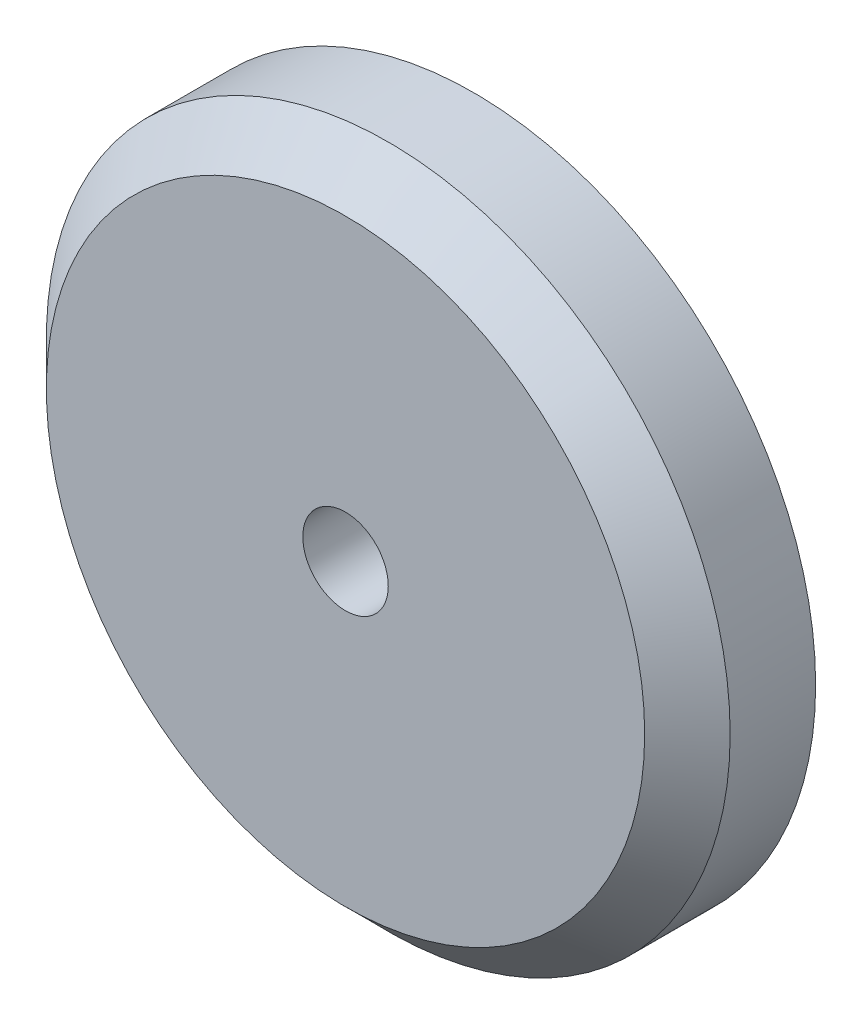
from build123d import *

# Parameters (mm, degrees)
ESQUISSE1_R        = 40
ESQUISSE1_R_2      = 5
BOSS_EXTRU_1_DEPTH = 15
CHANFREIN1_SIZE    = 5


with BuildPart() as part:
    # Esquisse1 → Boss.-Extru.1 (new body)
    with BuildSketch(Plane.XY):
        Circle(ESQUISSE1_R)
        Circle(ESQUISSE1_R_2, mode=Mode.SUBTRACT)
    extrude(amount=BOSS_EXTRU_1_DEPTH)

    # Chanfrein1
    chanfrein1_edges = [part.edges().sort_by_distance(p)[0] for p in [
        (-40, 0, 15),
    ]]
    chamfer(chanfrein1_edges, length=CHANFREIN1_SIZE)


solid = part.part
